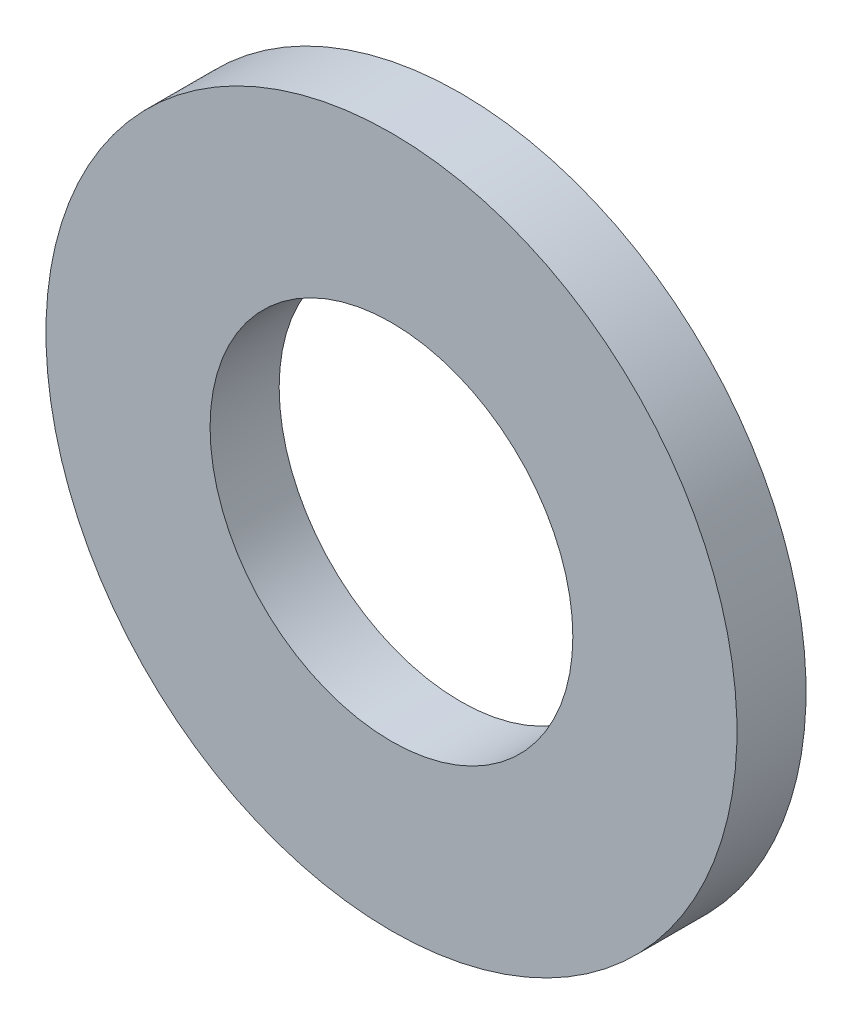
from build123d import *

# Parameters (mm, degrees)
SKIZZE1_W = 2
SKIZZE1_H = 4.75


with BuildPart() as part:
    # Skizze1 → Basis-Rotation (revolve)
    with BuildSketch(Plane(origin=(0, 0, 0), x_dir=(0, 0, -1), z_dir=(1, 0, 0)), mode=Mode.PRIVATE) as basis_rotation_sk:
        with Locations((-1, 7.625)):
            Rectangle(SKIZZE1_W, SKIZZE1_H)
    revolve(basis_rotation_sk.sketch.rotate(Axis((0, 0, 2), (0, 0, -1)), 180), axis=Axis((0, 0, 2), (0, 0, -1)))


solid = part.part
